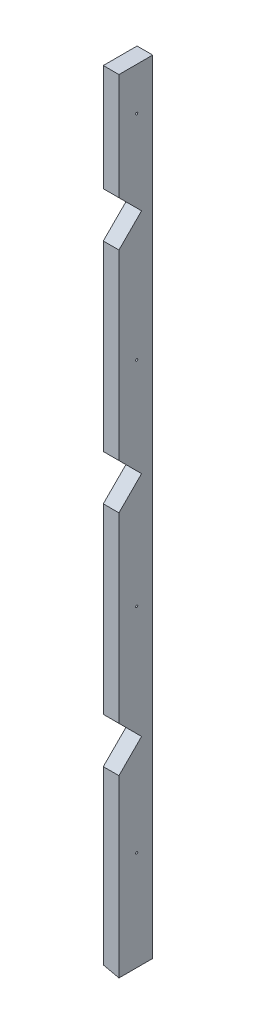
from build123d import *

# Parameters (mm, degrees)
SKETCH1_W                          = 22
SKETCH1_H                          = 47.5
EXTRUDE_H_JD_DEPTH                 = 1100
CUT_ROMBISKT_REGELUTTAG_DEPTH      = 1102.244863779
CUT_SKRUVH_L_REACH                 = 1103.245
SKETCH3_R                          = 1.5
CUT_SNEDKAP_BOTTEN_DEPTH           = 1102.244863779
CUT_SNEDKAP_BOTTEN_DEPTH_BACK      = 1102.244863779
LPATTERN_ROMBISKT_REGELUTTAG_COUNT = 3
LPATTERN_ROMBISKT_REGELUTTAG_PITCH = 320
LPATTERN_SKRUVH_L_COUNT            = 4
LPATTERN_SKRUVH_L_PITCH            = 300


with BuildPart() as part:
    # Sketch1 → Extrude h_jd (new body)
    with BuildSketch(Plane.XZ):
        with Locations((11, -23.75)):
            Rectangle(SKETCH1_W, SKETCH1_H)
    extrude(amount=-EXTRUDE_H_JD_DEPTH)

    # Sketch2 → Cut rombiskt regeluttag (cut, through all)
    with BuildSketch(Plane(origin=(0, 0, 0), x_dir=(0, 0, -1), z_dir=(1, 0, 0))):
        Polygon((-886.360389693, 0), (-918.180194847, -31.819805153), (-950, 0), (-918.180194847, 31.819805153), align=None)
        Polygon((-31.819805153, 918.180194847), (0, 886.360389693), (31.819805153, 918.180194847), (0, 950), align=None)
    cut_rombiskt_regeluttag = extrude(amount=CUT_ROMBISKT_REGELUTTAG_DEPTH, mode=Mode.SUBTRACT)

    # Sketch3 → Cut skruvh_l (cut, up to next)
    with BuildSketch(Plane(origin=(0, 0, 0), x_dir=(0, 0, -1), z_dir=(1, 0, 0)), mode=Mode.PRIVATE) as cut_skruvh_l_sk1:
        with Locations((25, 1040)):
            Circle(SKETCH3_R)
    cut_skruvh_l_tool1 = extrude(cut_skruvh_l_sk1.sketch, amount=CUT_SKRUVH_L_REACH, mode=Mode.PRIVATE) & part.part
    cut_skruvh_l = cut_skruvh_l_tool1.solids().sort_by_distance((0, 1040, -25))[0]
    add(cut_skruvh_l, mode=Mode.SUBTRACT)

    # Sketch4 → Cut snedkap botten (cut, two sides: drawn at the far end of the back side and taken through both)
    with BuildSketch(Plane.XY.offset(-CUT_SNEDKAP_BOTTEN_DEPTH_BACK)):
        Polygon((-2155.472626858, 494.880142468), (0, 5), (22, 0), (2177.472626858, -489.880142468), (1197.712341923, -4800.825396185), (-3135.232911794, -3816.065111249), align=None)
    extrude(amount=CUT_SNEDKAP_BOTTEN_DEPTH + CUT_SNEDKAP_BOTTEN_DEPTH_BACK, mode=Mode.SUBTRACT)

    # LPattern rombiskt regeluttag: Cut rombiskt regeluttag ×3
    with Locations(*[(0, -i * LPATTERN_ROMBISKT_REGELUTTAG_PITCH, 0) for i in range(1, LPATTERN_ROMBISKT_REGELUTTAG_COUNT)]):
        add(cut_rombiskt_regeluttag, mode=Mode.SUBTRACT)

    # LPattern skruvh_l: Cut skruvh_l ×4
    with Locations(*[(0, -i * LPATTERN_SKRUVH_L_PITCH, 0) for i in range(1, LPATTERN_SKRUVH_L_COUNT)]):
        add(cut_skruvh_l, mode=Mode.SUBTRACT)


solid = part.part
